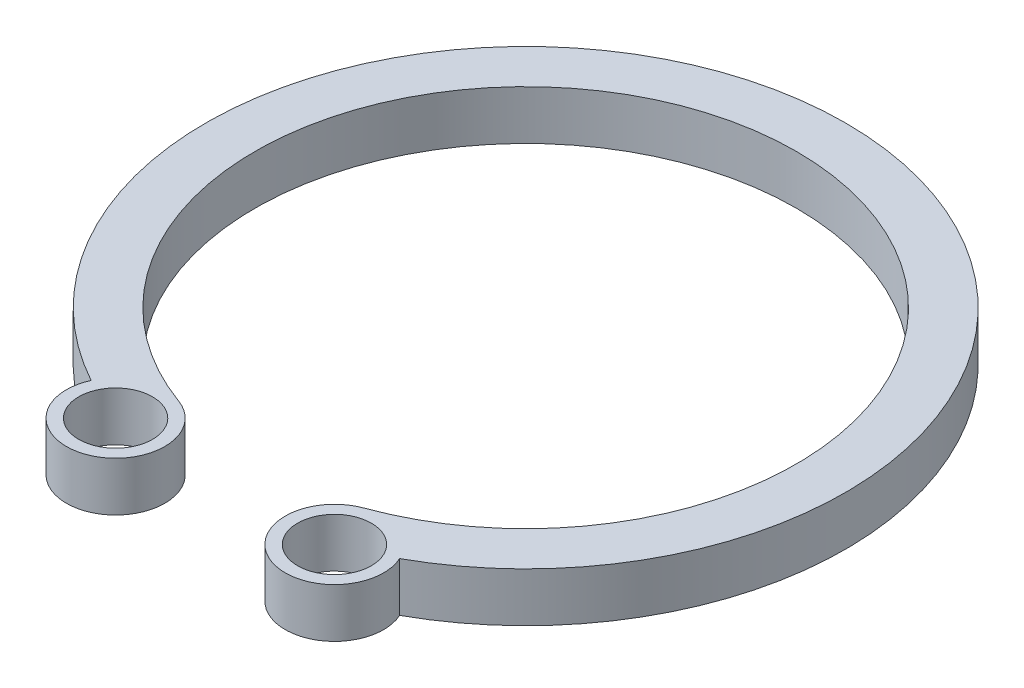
from build123d import *

# Parameters (mm, degrees)
SKETCH_1_R      = 0.75
EXTRUDE_1_DEPTH = 1


with BuildPart() as part:
    # Sketch 1 → Extrude 1 (new body)
    with BuildSketch(Plane(origin=(0, 0, 0), x_dir=(1, 0, 0), z_dir=(0, 1, 0))):
        with BuildLine():
            ThreePointArc((3.13373003, -5.694711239), (0, 6.5), (-3.13373003, -5.694711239))
            ThreePointArc((-3.13373003, -5.694711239), (-1.835709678, -7.029904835), (-1.881110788, -5.168309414))
            ThreePointArc((-1.881110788, -5.168309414), (0, 5.5), (1.881110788, -5.168309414))
            ThreePointArc((1.881110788, -5.168309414), (1.835709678, -7.029904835), (3.13373003, -5.694711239))
        make_face()
        with Locations(Location((-2.223130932, -6.108002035, 0), (0, 0, 270))):
            Circle(SKETCH_1_R, mode=Mode.SUBTRACT)
        with Locations(Location((2.223130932, -6.108002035, 0), (0, 0, 90))):
            Circle(SKETCH_1_R, mode=Mode.SUBTRACT)
    extrude(amount=EXTRUDE_1_DEPTH)


solid = part.part
